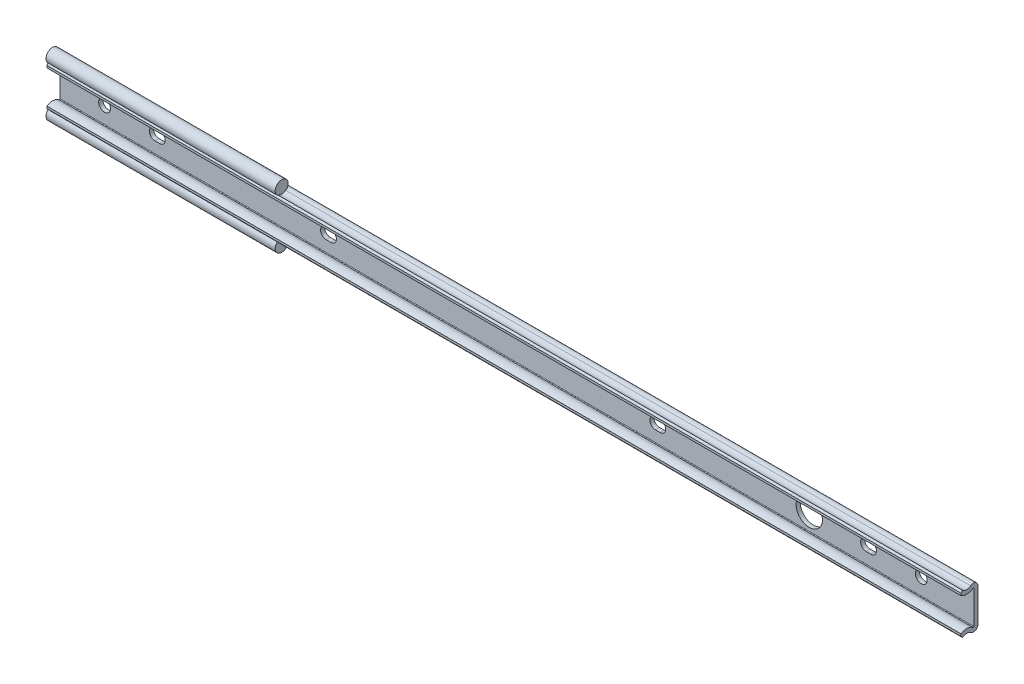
ISO-10303-21;
HEADER;
FILE_DESCRIPTION(('STEP AP214'),'2;1');
FILE_NAME('part.step','',(''),(''),'','','');
FILE_SCHEMA(('AUTOMOTIVE_DESIGN { 1 0 10303 214 1 1 1 1 }'));
ENDSEC;
DATA;
#1=APPLICATION_CONTEXT('core data for automotive mechanical design processes');
#2=APPLICATION_PROTOCOL_DEFINITION('international standard','automotive_design',2000,#1);
#3=PRODUCT_CONTEXT('',#1,'mechanical');
#4=PRODUCT('Part','Part','',(#3));
#5=PRODUCT_RELATED_PRODUCT_CATEGORY('part','',(#4));
#6=PRODUCT_DEFINITION_FORMATION('','',#4);
#7=PRODUCT_DEFINITION_CONTEXT('part definition',#1,'design');
#8=PRODUCT_DEFINITION('design','',#6,#7);
#9=PRODUCT_DEFINITION_SHAPE('','',#8);
#10=(LENGTH_UNIT() NAMED_UNIT(*) SI_UNIT(.MILLI.,.METRE.));
#11=(NAMED_UNIT(*) PLANE_ANGLE_UNIT() SI_UNIT($,.RADIAN.));
#12=(NAMED_UNIT(*) SI_UNIT($,.STERADIAN.) SOLID_ANGLE_UNIT());
#13=UNCERTAINTY_MEASURE_WITH_UNIT(LENGTH_MEASURE(1.E-05),#10,'distance_accuracy_value','');
#14=(GEOMETRIC_REPRESENTATION_CONTEXT(3) GLOBAL_UNCERTAINTY_ASSIGNED_CONTEXT((#13)) GLOBAL_UNIT_ASSIGNED_CONTEXT((#10,
#11,#12)) REPRESENTATION_CONTEXT('',''));
#15=CARTESIAN_POINT('',(0.,0.,0.));
#16=DIRECTION('',(0.,0.,1.));
#17=DIRECTION('',(1.,0.,0.));
#18=AXIS2_PLACEMENT_3D('',#15,#16,#17);
#19=CARTESIAN_POINT('',(330.,9.67006993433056,4.30999988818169));
#20=DIRECTION('',(-1.,0.,0.));
#21=DIRECTION('',(0.,0.,1.));
#22=AXIS2_PLACEMENT_3D('',#19,#20,#21);
#23=CYLINDRICAL_SURFACE('',#22,2.48);
#24=DIRECTION('',(-1.,0.,0.));
#25=VECTOR('',#24,1.);
#26=CARTESIAN_POINT('',(330.,7.6958095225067,2.80910154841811));
#27=LINE('',#26,#25);
#28=CARTESIAN_POINT('',(330.,7.6958095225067,2.80910154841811));
#29=VERTEX_POINT('',#28);
#30=CARTESIAN_POINT('',(70.,7.6958095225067,2.80910154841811));
#31=VERTEX_POINT('',#30);
#32=EDGE_CURVE('E278',#29,#31,#27,.T.);
#33=ORIENTED_EDGE('',*,*,#32,.T.);
#34=CARTESIAN_POINT('',(70.,9.67006993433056,4.30999988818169));
#35=DIRECTION('',(-1.,0.,0.));
#36=DIRECTION('',(0.,0.,1.));
#37=AXIS2_PLACEMENT_3D('',#34,#35,#36);
#38=CIRCLE('',#37,2.48);
#39=CARTESIAN_POINT('',(70.,7.77027971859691,5.9041131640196));
#40=VERTEX_POINT('',#39);
#41=EDGE_CURVE('E392',#31,#40,#38,.T.);
#42=ORIENTED_EDGE('',*,*,#41,.T.);
#43=DIRECTION('',(-1.,0.,0.));
#44=VECTOR('',#43,1.);
#45=CARTESIAN_POINT('',(330.,7.77027971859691,5.9041131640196));
#46=LINE('',#45,#44);
#47=CARTESIAN_POINT('',(330.,7.77027971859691,5.9041131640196));
#48=VERTEX_POINT('',#47);
#49=EDGE_CURVE('E281',#48,#40,#46,.T.);
#50=ORIENTED_EDGE('',*,*,#49,.F.);
#51=CARTESIAN_POINT('',(330.,9.67006993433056,4.30999988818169));
#52=DIRECTION('',(1.,0.,0.));
#53=DIRECTION('',(0.,0.,-1.));
#54=AXIS2_PLACEMENT_3D('',#51,#52,#53);
#55=CIRCLE('',#54,2.48);
#56=EDGE_CURVE('E401',#48,#29,#55,.T.);
#57=ORIENTED_EDGE('',*,*,#56,.T.);
#58=EDGE_LOOP('',(#33,#42,#50,#57));
#59=FACE_BOUND('',#58,.T.);
#60=ADVANCED_FACE('F14',(#59),#23,.F.);
#61=CARTESIAN_POINT('',(330.,-6.30268270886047,1.74999971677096));
#62=DIRECTION('',(-1.,0.,0.));
#63=DIRECTION('',(0.,0.,1.));
#64=AXIS2_PLACEMENT_3D('',#61,#62,#63);
#65=CYLINDRICAL_SURFACE('',#64,1.74999971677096);
#66=CARTESIAN_POINT('',(70.,-6.30268270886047,1.74999971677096));
#67=DIRECTION('',(1.,0.,0.));
#68=DIRECTION('',(0.,0.,-1.));
#69=AXIS2_PLACEMENT_3D('',#66,#67,#68);
#70=CIRCLE('',#69,1.74999971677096);
#71=CARTESIAN_POINT('',(70.,-7.6958095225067,2.80910154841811));
#72=VERTEX_POINT('',#71);
#73=CARTESIAN_POINT('',(70.,-7.94505035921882,2.35425753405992));
#74=VERTEX_POINT('',#73);
#75=EDGE_CURVE('E29',#72,#74,#70,.T.);
#76=ORIENTED_EDGE('',*,*,#75,.T.);
#77=DIRECTION('',(-1.,0.,0.));
#78=VECTOR('',#77,1.);
#79=CARTESIAN_POINT('',(26.5,-7.94505035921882,2.35425753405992));
#80=LINE('',#79,#78);
#81=CARTESIAN_POINT('',(-17.,-7.94505035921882,2.35425753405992));
#82=VERTEX_POINT('',#81);
#83=EDGE_CURVE('E530',#74,#82,#80,.T.);
#84=ORIENTED_EDGE('',*,*,#83,.T.);
#85=CARTESIAN_POINT('',(-17.,-6.30268270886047,1.74999971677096));
#86=DIRECTION('',(1.,0.,0.));
#87=DIRECTION('',(0.,0.,-1.));
#88=AXIS2_PLACEMENT_3D('',#85,#86,#87);
#89=CIRCLE('',#88,1.74999971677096);
#90=CARTESIAN_POINT('',(-17.,-6.30268270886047,0.));
#91=VERTEX_POINT('',#90);
#92=EDGE_CURVE('E432',#82,#91,#89,.T.);
#93=ORIENTED_EDGE('',*,*,#92,.T.);
#94=DIRECTION('',(-1.,0.,0.));
#95=VECTOR('',#94,1.);
#96=CARTESIAN_POINT('',(330.,-6.30268270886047,0.));
#97=LINE('',#96,#95);
#98=CARTESIAN_POINT('',(330.,-6.30268270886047,0.));
#99=VERTEX_POINT('',#98);
#100=EDGE_CURVE('E324',#99,#91,#97,.T.);
#101=ORIENTED_EDGE('',*,*,#100,.F.);
#102=CARTESIAN_POINT('',(330.,-6.30268270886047,1.74999971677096));
#103=DIRECTION('',(1.,0.,0.));
#104=DIRECTION('',(0.,0.,-1.));
#105=AXIS2_PLACEMENT_3D('',#102,#103,#104);
#106=CIRCLE('',#105,1.74999971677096);
#107=CARTESIAN_POINT('',(330.,-7.6958095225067,2.80910154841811));
#108=VERTEX_POINT('',#107);
#109=EDGE_CURVE('E294',#108,#99,#106,.T.);
#110=ORIENTED_EDGE('',*,*,#109,.F.);
#111=DIRECTION('',(-1.,0.,0.));
#112=VECTOR('',#111,1.);
#113=CARTESIAN_POINT('',(330.,-7.6958095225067,2.80910154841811));
#114=LINE('',#113,#112);
#115=EDGE_CURVE('E310',#108,#72,#114,.T.);
#116=ORIENTED_EDGE('',*,*,#115,.T.);
#117=EDGE_LOOP('',(#76,#84,#93,#101,#110,#116));
#118=FACE_BOUND('',#117,.T.);
#119=ADVANCED_FACE('F16',(#118),#65,.T.);
#120=CARTESIAN_POINT('',(330.,-6.30268270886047,0.));
#121=DIRECTION('',(0.,0.,1.));
#122=DIRECTION('',(0.,-1.,0.));
#123=AXIS2_PLACEMENT_3D('',#120,#121,#122);
#124=PLANE('',#123);
#125=CARTESIAN_POINT('',(310.,0.,0.));
#126=DIRECTION('',(0.,0.,-1.));
#127=DIRECTION('',(0.,1.,0.));
#128=AXIS2_PLACEMENT_3D('',#125,#126,#127);
#129=CIRCLE('',#128,2.24999999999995);
#130=CARTESIAN_POINT('',(310.,2.24999999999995,0.));
#131=VERTEX_POINT('',#130);
#132=EDGE_CURVE('E356',#131,#131,#129,.T.);
#133=ORIENTED_EDGE('',*,*,#132,.F.);
#134=EDGE_LOOP('',(#133));
#135=FACE_BOUND('',#134,.T.);
#136=DIRECTION('',(-1.,0.,0.));
#137=VECTOR('',#136,1.);
#138=CARTESIAN_POINT('',(20.9,-2.1,0.));
#139=LINE('',#138,#137);
#140=CARTESIAN_POINT('',(20.9,-2.1,0.));
#141=VERTEX_POINT('',#140);
#142=CARTESIAN_POINT('',(19.1,-2.1,0.));
#143=VERTEX_POINT('',#142);
#144=EDGE_CURVE('E501',#141,#143,#139,.T.);
#145=ORIENTED_EDGE('',*,*,#144,.F.);
#146=CARTESIAN_POINT('',(20.9,0.,0.));
#147=DIRECTION('',(0.,0.,-1.));
#148=DIRECTION('',(0.,1.,0.));
#149=AXIS2_PLACEMENT_3D('',#146,#147,#148);
#150=CIRCLE('',#149,2.1);
#151=CARTESIAN_POINT('',(20.9,2.1,0.));
#152=VERTEX_POINT('',#151);
#153=EDGE_CURVE('E245',#152,#141,#150,.T.);
#154=ORIENTED_EDGE('',*,*,#153,.F.);
#155=DIRECTION('',(1.,0.,0.));
#156=VECTOR('',#155,1.);
#157=CARTESIAN_POINT('',(20.9,2.1,0.));
#158=LINE('',#157,#156);
#159=CARTESIAN_POINT('',(19.1,2.1,0.));
#160=VERTEX_POINT('',#159);
#161=EDGE_CURVE('E489',#160,#152,#158,.T.);
#162=ORIENTED_EDGE('',*,*,#161,.F.);
#163=CARTESIAN_POINT('',(19.1,0.,0.));
#164=DIRECTION('',(0.,0.,-1.));
#165=DIRECTION('',(0.,1.,0.));
#166=AXIS2_PLACEMENT_3D('',#163,#164,#165);
#167=CIRCLE('',#166,2.1);
#168=EDGE_CURVE('E498',#143,#160,#167,.T.);
#169=ORIENTED_EDGE('',*,*,#168,.F.);
#170=EDGE_LOOP('',(#145,#154,#162,#169));
#171=FACE_BOUND('',#170,.T.);
#172=DIRECTION('',(-1.,0.,0.));
#173=VECTOR('',#172,1.);
#174=CARTESIAN_POINT('',(85.9,-2.1,0.));
#175=LINE('',#174,#173);
#176=CARTESIAN_POINT('',(85.9,-2.1,0.));
#177=VERTEX_POINT('',#176);
#178=CARTESIAN_POINT('',(84.1,-2.1,0.));
#179=VERTEX_POINT('',#178);
#180=EDGE_CURVE('E519',#177,#179,#175,.T.);
#181=ORIENTED_EDGE('',*,*,#180,.F.);
#182=CARTESIAN_POINT('',(85.9,0.,0.));
#183=DIRECTION('',(0.,0.,-1.));
#184=DIRECTION('',(0.,1.,0.));
#185=AXIS2_PLACEMENT_3D('',#182,#183,#184);
#186=CIRCLE('',#185,2.1);
#187=CARTESIAN_POINT('',(85.9,2.1,0.));
#188=VERTEX_POINT('',#187);
#189=EDGE_CURVE('E495',#188,#177,#186,.T.);
#190=ORIENTED_EDGE('',*,*,#189,.F.);
#191=DIRECTION('',(1.,0.,0.));
#192=VECTOR('',#191,1.);
#193=CARTESIAN_POINT('',(85.9,2.1,0.));
#194=LINE('',#193,#192);
#195=CARTESIAN_POINT('',(84.1,2.1,0.));
#196=VERTEX_POINT('',#195);
#197=EDGE_CURVE('E509',#196,#188,#194,.T.);
#198=ORIENTED_EDGE('',*,*,#197,.F.);
#199=CARTESIAN_POINT('',(84.1,0.,0.));
#200=DIRECTION('',(0.,0.,-1.));
#201=DIRECTION('',(0.,1.,0.));
#202=AXIS2_PLACEMENT_3D('',#199,#200,#201);
#203=CIRCLE('',#202,2.1);
#204=EDGE_CURVE('E516',#179,#196,#203,.T.);
#205=ORIENTED_EDGE('',*,*,#204,.F.);
#206=EDGE_LOOP('',(#181,#190,#198,#205));
#207=FACE_BOUND('',#206,.T.);
#208=CARTESIAN_POINT('',(0.,0.,0.));
#209=DIRECTION('',(0.,0.,-1.));
#210=DIRECTION('',(0.,1.,0.));
#211=AXIS2_PLACEMENT_3D('',#208,#209,#210);
#212=CIRCLE('',#211,2.25);
#213=CARTESIAN_POINT('',(0.,2.25,0.));
#214=VERTEX_POINT('',#213);
#215=EDGE_CURVE('E441',#214,#214,#212,.T.);
#216=ORIENTED_EDGE('',*,*,#215,.F.);
#217=EDGE_LOOP('',(#216));
#218=FACE_BOUND('',#217,.T.);
#219=CARTESIAN_POINT('',(267.5,0.,0.));
#220=DIRECTION('',(0.,0.,-1.));
#221=DIRECTION('',(0.,1.,0.));
#222=AXIS2_PLACEMENT_3D('',#219,#220,#221);
#223=CIRCLE('',#222,5.);
#224=CARTESIAN_POINT('',(267.5,5.,0.));
#225=VERTEX_POINT('',#224);
#226=EDGE_CURVE('E438',#225,#225,#223,.T.);
#227=ORIENTED_EDGE('',*,*,#226,.F.);
#228=EDGE_LOOP('',(#227));
#229=FACE_BOUND('',#228,.T.);
#230=DIRECTION('',(-1.,0.,0.));
#231=VECTOR('',#230,1.);
#232=CARTESIAN_POINT('',(290.9,-2.1,0.));
#233=LINE('',#232,#231);
#234=CARTESIAN_POINT('',(290.9,-2.1,0.));
#235=VERTEX_POINT('',#234);
#236=CARTESIAN_POINT('',(289.1,-2.1,0.));
#237=VERTEX_POINT('',#236);
#238=EDGE_CURVE('E481',#235,#237,#233,.T.);
#239=ORIENTED_EDGE('',*,*,#238,.F.);
#240=CARTESIAN_POINT('',(290.9,0.,0.));
#241=DIRECTION('',(0.,0.,-1.));
#242=DIRECTION('',(0.,1.,0.));
#243=AXIS2_PLACEMENT_3D('',#240,#241,#242);
#244=CIRCLE('',#243,2.1);
#245=CARTESIAN_POINT('',(290.9,2.1,0.));
#246=VERTEX_POINT('',#245);
#247=EDGE_CURVE('E455',#246,#235,#244,.T.);
#248=ORIENTED_EDGE('',*,*,#247,.F.);
#249=DIRECTION('',(1.,0.,0.));
#250=VECTOR('',#249,1.);
#251=CARTESIAN_POINT('',(290.9,2.1,0.));
#252=LINE('',#251,#250);
#253=CARTESIAN_POINT('',(289.1,2.1,0.));
#254=VERTEX_POINT('',#253);
#255=EDGE_CURVE('E471',#254,#246,#252,.T.);
#256=ORIENTED_EDGE('',*,*,#255,.F.);
#257=CARTESIAN_POINT('',(289.1,0.,0.));
#258=DIRECTION('',(0.,0.,-1.));
#259=DIRECTION('',(0.,1.,0.));
#260=AXIS2_PLACEMENT_3D('',#257,#258,#259);
#261=CIRCLE('',#260,2.1);
#262=EDGE_CURVE('E478',#237,#254,#261,.T.);
#263=ORIENTED_EDGE('',*,*,#262,.F.);
#264=EDGE_LOOP('',(#239,#248,#256,#263));
#265=FACE_BOUND('',#264,.T.);
#266=DIRECTION('',(-1.,0.,0.));
#267=VECTOR('',#266,1.);
#268=CARTESIAN_POINT('',(210.9,-2.1,0.));
#269=LINE('',#268,#267);
#270=CARTESIAN_POINT('',(210.9,-2.1,0.));
#271=VERTEX_POINT('',#270);
#272=CARTESIAN_POINT('',(209.1,-2.1,0.));
#273=VERTEX_POINT('',#272);
#274=EDGE_CURVE('E461',#271,#273,#269,.T.);
#275=ORIENTED_EDGE('',*,*,#274,.F.);
#276=CARTESIAN_POINT('',(210.9,0.,0.));
#277=DIRECTION('',(0.,0.,-1.));
#278=DIRECTION('',(0.,1.,0.));
#279=AXIS2_PLACEMENT_3D('',#276,#277,#278);
#280=CIRCLE('',#279,2.1);
#281=CARTESIAN_POINT('',(210.9,2.1,0.));
#282=VERTEX_POINT('',#281);
#283=EDGE_CURVE('E464',#282,#271,#280,.T.);
#284=ORIENTED_EDGE('',*,*,#283,.F.);
#285=DIRECTION('',(1.,0.,0.));
#286=VECTOR('',#285,1.);
#287=CARTESIAN_POINT('',(210.9,2.1,0.));
#288=LINE('',#287,#286);
#289=CARTESIAN_POINT('',(209.1,2.1,0.));
#290=VERTEX_POINT('',#289);
#291=EDGE_CURVE('E449',#290,#282,#288,.T.);
#292=ORIENTED_EDGE('',*,*,#291,.F.);
#293=CARTESIAN_POINT('',(209.1,0.,0.));
#294=DIRECTION('',(0.,0.,-1.));
#295=DIRECTION('',(0.,1.,0.));
#296=AXIS2_PLACEMENT_3D('',#293,#294,#295);
#297=CIRCLE('',#296,2.1);
#298=EDGE_CURVE('E458',#273,#290,#297,.T.);
#299=ORIENTED_EDGE('',*,*,#298,.F.);
#300=EDGE_LOOP('',(#275,#284,#292,#299));
#301=FACE_BOUND('',#300,.T.);
#302=ORIENTED_EDGE('',*,*,#100,.T.);
#303=DIRECTION('',(0.,1.,0.));
#304=VECTOR('',#303,1.);
#305=CARTESIAN_POINT('',(-17.,-6.30268270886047,0.));
#306=LINE('',#305,#304);
#307=CARTESIAN_POINT('',(-17.,6.30268270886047,0.));
#308=VERTEX_POINT('',#307);
#309=EDGE_CURVE('E276',#91,#308,#306,.T.);
#310=ORIENTED_EDGE('',*,*,#309,.T.);
#311=DIRECTION('',(-1.,0.,0.));
#312=VECTOR('',#311,1.);
#313=CARTESIAN_POINT('',(330.,6.30268270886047,0.));
#314=LINE('',#313,#312);
#315=CARTESIAN_POINT('',(330.,6.30268270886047,0.));
#316=VERTEX_POINT('',#315);
#317=EDGE_CURVE('E263',#316,#308,#314,.T.);
#318=ORIENTED_EDGE('',*,*,#317,.F.);
#319=DIRECTION('',(0.,1.,0.));
#320=VECTOR('',#319,1.);
#321=CARTESIAN_POINT('',(330.,-6.30268270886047,0.));
#322=LINE('',#321,#320);
#323=EDGE_CURVE('E296',#99,#316,#322,.T.);
#324=ORIENTED_EDGE('',*,*,#323,.F.);
#325=EDGE_LOOP('',(#302,#310,#318,#324));
#326=FACE_BOUND('',#325,.T.);
#327=ADVANCED_FACE('F600',(#135,#171,#207,#218,#229,#265,#301,#326),#124,.F.);
#328=CARTESIAN_POINT('',(330.,-6.30268270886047,1.54999999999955));
#329=DIRECTION('',(0.,0.,-1.));
#330=DIRECTION('',(-1.,0.,0.));
#331=AXIS2_PLACEMENT_3D('',#328,#329,#330);
#332=PLANE('',#331);
#333=CARTESIAN_POINT('',(310.,0.,1.54999999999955));
#334=DIRECTION('',(0.,0.,-1.));
#335=DIRECTION('',(-1.,0.,0.));
#336=AXIS2_PLACEMENT_3D('',#333,#334,#335);
#337=CIRCLE('',#336,2.24999999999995);
#338=CARTESIAN_POINT('',(307.75,0.,1.54999999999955));
#339=VERTEX_POINT('',#338);
#340=EDGE_CURVE('E359',#339,#339,#337,.T.);
#341=ORIENTED_EDGE('',*,*,#340,.T.);
#342=EDGE_LOOP('',(#341));
#343=FACE_BOUND('',#342,.T.);
#344=DIRECTION('',(1.,0.,0.));
#345=VECTOR('',#344,1.);
#346=CARTESIAN_POINT('',(330.,2.09999999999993,1.54999999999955));
#347=LINE('',#346,#345);
#348=CARTESIAN_POINT('',(19.1,2.1,1.54999999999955));
#349=VERTEX_POINT('',#348);
#350=CARTESIAN_POINT('',(20.9,2.1,1.54999999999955));
#351=VERTEX_POINT('',#350);
#352=EDGE_CURVE('E377',#349,#351,#347,.T.);
#353=ORIENTED_EDGE('',*,*,#352,.T.);
#354=CARTESIAN_POINT('',(20.9,0.,1.54999999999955));
#355=DIRECTION('',(0.,0.,-1.));
#356=DIRECTION('',(-1.,0.,0.));
#357=AXIS2_PLACEMENT_3D('',#354,#355,#356);
#358=CIRCLE('',#357,2.1);
#359=CARTESIAN_POINT('',(20.9,-2.1,1.54999999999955));
#360=VERTEX_POINT('',#359);
#361=EDGE_CURVE('E380',#351,#360,#358,.T.);
#362=ORIENTED_EDGE('',*,*,#361,.T.);
#363=DIRECTION('',(-1.,0.,0.));
#364=VECTOR('',#363,1.);
#365=CARTESIAN_POINT('',(330.,-2.1,1.54999999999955));
#366=LINE('',#365,#364);
#367=CARTESIAN_POINT('',(19.1,-2.1,1.54999999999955));
#368=VERTEX_POINT('',#367);
#369=EDGE_CURVE('E371',#360,#368,#366,.T.);
#370=ORIENTED_EDGE('',*,*,#369,.T.);
#371=CARTESIAN_POINT('',(19.1,0.,1.54999999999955));
#372=DIRECTION('',(0.,0.,-1.));
#373=DIRECTION('',(-1.,0.,0.));
#374=AXIS2_PLACEMENT_3D('',#371,#372,#373);
#375=CIRCLE('',#374,2.1);
#376=EDGE_CURVE('E374',#368,#349,#375,.T.);
#377=ORIENTED_EDGE('',*,*,#376,.T.);
#378=EDGE_LOOP('',(#353,#362,#370,#377));
#379=FACE_BOUND('',#378,.T.);
#380=DIRECTION('',(1.,0.,0.));
#381=VECTOR('',#380,1.);
#382=CARTESIAN_POINT('',(330.,2.09999999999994,1.54999999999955));
#383=LINE('',#382,#381);
#384=CARTESIAN_POINT('',(84.1,2.1,1.54999999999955));
#385=VERTEX_POINT('',#384);
#386=CARTESIAN_POINT('',(85.9,2.1,1.54999999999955));
#387=VERTEX_POINT('',#386);
#388=EDGE_CURVE('E365',#385,#387,#383,.T.);
#389=ORIENTED_EDGE('',*,*,#388,.T.);
#390=CARTESIAN_POINT('',(85.9,0.,1.54999999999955));
#391=DIRECTION('',(0.,0.,-1.));
#392=DIRECTION('',(-1.,0.,0.));
#393=AXIS2_PLACEMENT_3D('',#390,#391,#392);
#394=CIRCLE('',#393,2.1);
#395=CARTESIAN_POINT('',(85.9,-2.1,1.54999999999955));
#396=VERTEX_POINT('',#395);
#397=EDGE_CURVE('E368',#387,#396,#394,.T.);
#398=ORIENTED_EDGE('',*,*,#397,.T.);
#399=DIRECTION('',(-1.,0.,0.));
#400=VECTOR('',#399,1.);
#401=CARTESIAN_POINT('',(330.,-2.1,1.54999999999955));
#402=LINE('',#401,#400);
#403=CARTESIAN_POINT('',(84.1,-2.1,1.54999999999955));
#404=VERTEX_POINT('',#403);
#405=EDGE_CURVE('E351',#396,#404,#402,.T.);
#406=ORIENTED_EDGE('',*,*,#405,.T.);
#407=CARTESIAN_POINT('',(84.1,0.,1.54999999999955));
#408=DIRECTION('',(0.,0.,-1.));
#409=DIRECTION('',(-1.,0.,0.));
#410=AXIS2_PLACEMENT_3D('',#407,#408,#409);
#411=CIRCLE('',#410,2.1);
#412=EDGE_CURVE('E362',#404,#385,#411,.T.);
#413=ORIENTED_EDGE('',*,*,#412,.T.);
#414=EDGE_LOOP('',(#389,#398,#406,#413));
#415=FACE_BOUND('',#414,.T.);
#416=CARTESIAN_POINT('',(0.,0.,1.54999999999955));
#417=DIRECTION('',(0.,0.,-1.));
#418=DIRECTION('',(-1.,0.,0.));
#419=AXIS2_PLACEMENT_3D('',#416,#417,#418);
#420=CIRCLE('',#419,2.25);
#421=CARTESIAN_POINT('',(-2.25,0.,1.54999999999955));
#422=VERTEX_POINT('',#421);
#423=EDGE_CURVE('E355',#422,#422,#420,.T.);
#424=ORIENTED_EDGE('',*,*,#423,.T.);
#425=EDGE_LOOP('',(#424));
#426=FACE_BOUND('',#425,.T.);
#427=CARTESIAN_POINT('',(267.5,0.,1.54999999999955));
#428=DIRECTION('',(0.,0.,-1.));
#429=DIRECTION('',(-1.,0.,0.));
#430=AXIS2_PLACEMENT_3D('',#427,#428,#429);
#431=CIRCLE('',#430,5.);
#432=CARTESIAN_POINT('',(262.5,0.,1.54999999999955));
#433=VERTEX_POINT('',#432);
#434=EDGE_CURVE('E352',#433,#433,#431,.T.);
#435=ORIENTED_EDGE('',*,*,#434,.T.);
#436=EDGE_LOOP('',(#435));
#437=FACE_BOUND('',#436,.T.);
#438=DIRECTION('',(1.,0.,0.));
#439=VECTOR('',#438,1.);
#440=CARTESIAN_POINT('',(330.,2.1,1.54999999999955));
#441=LINE('',#440,#439);
#442=CARTESIAN_POINT('',(289.1,2.1,1.54999999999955));
#443=VERTEX_POINT('',#442);
#444=CARTESIAN_POINT('',(290.9,2.1,1.54999999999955));
#445=VERTEX_POINT('',#444);
#446=EDGE_CURVE('E345',#443,#445,#441,.T.);
#447=ORIENTED_EDGE('',*,*,#446,.T.);
#448=CARTESIAN_POINT('',(290.9,0.,1.54999999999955));
#449=DIRECTION('',(0.,0.,-1.));
#450=DIRECTION('',(-1.,0.,0.));
#451=AXIS2_PLACEMENT_3D('',#448,#449,#450);
#452=CIRCLE('',#451,2.1);
#453=CARTESIAN_POINT('',(290.9,-2.1,1.54999999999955));
#454=VERTEX_POINT('',#453);
#455=EDGE_CURVE('E348',#445,#454,#452,.T.);
#456=ORIENTED_EDGE('',*,*,#455,.T.);
#457=DIRECTION('',(-1.,0.,0.));
#458=VECTOR('',#457,1.);
#459=CARTESIAN_POINT('',(330.,-2.1,1.54999999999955));
#460=LINE('',#459,#458);
#461=CARTESIAN_POINT('',(289.1,-2.1,1.54999999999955));
#462=VERTEX_POINT('',#461);
#463=EDGE_CURVE('E339',#454,#462,#460,.T.);
#464=ORIENTED_EDGE('',*,*,#463,.T.);
#465=CARTESIAN_POINT('',(289.1,0.,1.54999999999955));
#466=DIRECTION('',(0.,0.,-1.));
#467=DIRECTION('',(-1.,0.,0.));
#468=AXIS2_PLACEMENT_3D('',#465,#466,#467);
#469=CIRCLE('',#468,2.1);
#470=EDGE_CURVE('E342',#462,#443,#469,.T.);
#471=ORIENTED_EDGE('',*,*,#470,.T.);
#472=EDGE_LOOP('',(#447,#456,#464,#471));
#473=FACE_BOUND('',#472,.T.);
#474=DIRECTION('',(1.,0.,0.));
#475=VECTOR('',#474,1.);
#476=CARTESIAN_POINT('',(330.,2.09999999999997,1.54999999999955));
#477=LINE('',#476,#475);
#478=CARTESIAN_POINT('',(209.1,2.1,1.54999999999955));
#479=VERTEX_POINT('',#478);
#480=CARTESIAN_POINT('',(210.9,2.1,1.54999999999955));
#481=VERTEX_POINT('',#480);
#482=EDGE_CURVE('E333',#479,#481,#477,.T.);
#483=ORIENTED_EDGE('',*,*,#482,.T.);
#484=CARTESIAN_POINT('',(210.9,0.,1.54999999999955));
#485=DIRECTION('',(0.,0.,-1.));
#486=DIRECTION('',(-1.,0.,0.));
#487=AXIS2_PLACEMENT_3D('',#484,#485,#486);
#488=CIRCLE('',#487,2.1);
#489=CARTESIAN_POINT('',(210.9,-2.1,1.54999999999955));
#490=VERTEX_POINT('',#489);
#491=EDGE_CURVE('E336',#481,#490,#488,.T.);
#492=ORIENTED_EDGE('',*,*,#491,.T.);
#493=DIRECTION('',(-1.,0.,0.));
#494=VECTOR('',#493,1.);
#495=CARTESIAN_POINT('',(330.,-2.1,1.54999999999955));
#496=LINE('',#495,#494);
#497=CARTESIAN_POINT('',(209.1,-2.1,1.54999999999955));
#498=VERTEX_POINT('',#497);
#499=EDGE_CURVE('E327',#490,#498,#496,.T.);
#500=ORIENTED_EDGE('',*,*,#499,.T.);
#501=CARTESIAN_POINT('',(209.1,0.,1.54999999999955));
#502=DIRECTION('',(0.,0.,-1.));
#503=DIRECTION('',(-1.,0.,0.));
#504=AXIS2_PLACEMENT_3D('',#501,#502,#503);
#505=CIRCLE('',#504,2.1);
#506=EDGE_CURVE('E330',#498,#479,#505,.T.);
#507=ORIENTED_EDGE('',*,*,#506,.T.);
#508=EDGE_LOOP('',(#483,#492,#500,#507));
#509=FACE_BOUND('',#508,.T.);
#510=DIRECTION('',(0.,-1.,0.));
#511=VECTOR('',#510,1.);
#512=CARTESIAN_POINT('',(-17.,-6.30268270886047,1.54999999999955));
#513=LINE('',#512,#511);
#514=CARTESIAN_POINT('',(-17.,6.30268270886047,1.54999999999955));
#515=VERTEX_POINT('',#514);
#516=CARTESIAN_POINT('',(-17.,-6.30268270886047,1.54999999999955));
#517=VERTEX_POINT('',#516);
#518=EDGE_CURVE('E292',#515,#517,#513,.T.);
#519=ORIENTED_EDGE('',*,*,#518,.T.);
#520=DIRECTION('',(-1.,0.,0.));
#521=VECTOR('',#520,1.);
#522=CARTESIAN_POINT('',(330.,-6.30268270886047,1.54999999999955));
#523=LINE('',#522,#521);
#524=CARTESIAN_POINT('',(330.,-6.30268270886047,1.54999999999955));
#525=VERTEX_POINT('',#524);
#526=EDGE_CURVE('E321',#525,#517,#523,.T.);
#527=ORIENTED_EDGE('',*,*,#526,.F.);
#528=DIRECTION('',(0.,-1.,0.));
#529=VECTOR('',#528,1.);
#530=CARTESIAN_POINT('',(330.,-6.30268270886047,1.54999999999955));
#531=LINE('',#530,#529);
#532=CARTESIAN_POINT('',(330.,6.30268270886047,1.54999999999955));
#533=VERTEX_POINT('',#532);
#534=EDGE_CURVE('E298',#533,#525,#531,.T.);
#535=ORIENTED_EDGE('',*,*,#534,.F.);
#536=DIRECTION('',(-1.,0.,0.));
#537=VECTOR('',#536,1.);
#538=CARTESIAN_POINT('',(330.,6.30268270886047,1.54999999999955));
#539=LINE('',#538,#537);
#540=EDGE_CURVE('E273',#533,#515,#539,.T.);
#541=ORIENTED_EDGE('',*,*,#540,.T.);
#542=EDGE_LOOP('',(#519,#527,#535,#541));
#543=FACE_BOUND('',#542,.T.);
#544=ADVANCED_FACE('F572',(#343,#379,#415,#426,#437,#473,#509,#543),#332,.F.);
#545=CARTESIAN_POINT('',(330.,-6.30268270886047,1.74999971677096));
#546=DIRECTION('',(-1.,0.,0.));
#547=DIRECTION('',(0.,0.,1.));
#548=AXIS2_PLACEMENT_3D('',#545,#546,#547);
#549=CYLINDRICAL_SURFACE('',#548,0.199999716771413);
#550=ORIENTED_EDGE('',*,*,#526,.T.);
#551=CARTESIAN_POINT('',(-17.,-6.30268270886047,1.74999971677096));
#552=DIRECTION('',(1.,0.,0.));
#553=DIRECTION('',(0.,0.,-1.));
#554=AXIS2_PLACEMENT_3D('',#551,#552,#553);
#555=CIRCLE('',#554,0.199999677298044);
#556=CARTESIAN_POINT('',(-17.,-6.4618966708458,1.87104001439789));
#557=VERTEX_POINT('',#556);
#558=EDGE_CURVE('E417',#517,#557,#555,.F.);
#559=ORIENTED_EDGE('',*,*,#558,.T.);
#560=DIRECTION('',(-1.,0.,0.));
#561=VECTOR('',#560,1.);
#562=CARTESIAN_POINT('',(330.,-6.46189676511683,1.87104008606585));
#563=LINE('',#562,#561);
#564=CARTESIAN_POINT('',(330.,-6.46189676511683,1.87104008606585));
#565=VERTEX_POINT('',#564);
#566=EDGE_CURVE('E319',#565,#557,#563,.T.);
#567=ORIENTED_EDGE('',*,*,#566,.F.);
#568=CARTESIAN_POINT('',(330.,-6.30268270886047,1.74999971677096));
#569=DIRECTION('',(-1.,0.,0.));
#570=DIRECTION('',(0.,0.,-1.));
#571=AXIS2_PLACEMENT_3D('',#568,#569,#570);
#572=CIRCLE('',#571,0.199999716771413);
#573=EDGE_CURVE('E300',#525,#565,#572,.T.);
#574=ORIENTED_EDGE('',*,*,#573,.F.);
#575=EDGE_LOOP('',(#550,#559,#567,#574));
#576=FACE_BOUND('',#575,.T.);
#577=ADVANCED_FACE('F568',(#576),#549,.F.);
#578=CARTESIAN_POINT('',(330.,-9.67006993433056,4.30999988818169));
#579=DIRECTION('',(-1.,0.,0.));
#580=DIRECTION('',(0.,0.,1.));
#581=AXIS2_PLACEMENT_3D('',#578,#579,#580);
#582=CYLINDRICAL_SURFACE('',#581,4.03);
#583=ORIENTED_EDGE('',*,*,#566,.T.);
#584=CARTESIAN_POINT('',(-17.,-9.67006993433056,4.30999988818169));
#585=DIRECTION('',(1.,0.,0.));
#586=DIRECTION('',(0.,0.,-1.));
#587=AXIS2_PLACEMENT_3D('',#584,#585,#586);
#588=CIRCLE('',#587,4.03000011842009);
#589=CARTESIAN_POINT('',(-17.,-6.26782067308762,6.47000017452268));
#590=VERTEX_POINT('',#589);
#591=EDGE_CURVE('E386',#557,#590,#588,.T.);
#592=ORIENTED_EDGE('',*,*,#591,.T.);
#593=DIRECTION('',(-1.,0.,0.));
#594=VECTOR('',#593,1.);
#595=CARTESIAN_POINT('',(330.,-6.26782067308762,6.46999987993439));
#596=LINE('',#595,#594);
#597=CARTESIAN_POINT('',(330.,-6.26782067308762,6.46999987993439));
#598=VERTEX_POINT('',#597);
#599=EDGE_CURVE('E317',#598,#590,#596,.T.);
#600=ORIENTED_EDGE('',*,*,#599,.F.);
#601=CARTESIAN_POINT('',(330.,-9.67006993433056,4.30999988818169));
#602=DIRECTION('',(1.,0.,0.));
#603=DIRECTION('',(0.,0.,-1.));
#604=AXIS2_PLACEMENT_3D('',#601,#602,#603);
#605=CIRCLE('',#604,4.03);
#606=EDGE_CURVE('E302',#565,#598,#605,.T.);
#607=ORIENTED_EDGE('',*,*,#606,.F.);
#608=EDGE_LOOP('',(#583,#592,#600,#607));
#609=FACE_BOUND('',#608,.T.);
#610=ADVANCED_FACE('F564',(#609),#582,.T.);
#611=CARTESIAN_POINT('',(330.,-6.26782067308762,6.46999987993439));
#612=DIRECTION('',(0.,0.,-1.));
#613=DIRECTION('',(-1.,0.,0.));
#614=AXIS2_PLACEMENT_3D('',#611,#612,#613);
#615=PLANE('',#614);
#616=ORIENTED_EDGE('',*,*,#599,.T.);
#617=DIRECTION('',(0.,-1.,0.));
#618=VECTOR('',#617,1.);
#619=CARTESIAN_POINT('',(-17.,-7.09588258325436,6.47000017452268));
#620=LINE('',#619,#618);
#621=CARTESIAN_POINT('',(-17.,-7.09588258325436,6.47000017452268));
#622=VERTEX_POINT('',#621);
#623=EDGE_CURVE('E429',#590,#622,#620,.T.);
#624=ORIENTED_EDGE('',*,*,#623,.T.);
#625=DIRECTION('',(-1.,0.,0.));
#626=VECTOR('',#625,1.);
#627=CARTESIAN_POINT('',(330.,-7.09588293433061,6.46999987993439));
#628=LINE('',#627,#626);
#629=CARTESIAN_POINT('',(330.,-7.09588293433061,6.46999987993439));
#630=VERTEX_POINT('',#629);
#631=EDGE_CURVE('E315',#630,#622,#628,.T.);
#632=ORIENTED_EDGE('',*,*,#631,.F.);
#633=DIRECTION('',(0.,-1.,0.));
#634=VECTOR('',#633,1.);
#635=CARTESIAN_POINT('',(330.,-6.26782067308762,6.46999987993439));
#636=LINE('',#635,#634);
#637=EDGE_CURVE('E304',#598,#630,#636,.T.);
#638=ORIENTED_EDGE('',*,*,#637,.F.);
#639=EDGE_LOOP('',(#616,#624,#632,#638));
#640=FACE_BOUND('',#639,.T.);
#641=ADVANCED_FACE('F560',(#640),#615,.F.);
#642=CARTESIAN_POINT('',(330.,-7.77027971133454,5.90411315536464));
#643=DIRECTION('',(0.,0.642788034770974,-0.766044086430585));
#644=DIRECTION('',(0.,0.766044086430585,0.642788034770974));
#645=AXIS2_PLACEMENT_3D('',#642,#643,#644);
#646=PLANE('',#645);
#647=DIRECTION('',(0.,-0.766044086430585,-0.642788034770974));
#648=VECTOR('',#647,1.);
#649=CARTESIAN_POINT('',(-17.,-7.77027971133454,5.90411315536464));
#650=LINE('',#649,#648);
#651=CARTESIAN_POINT('',(-17.,-7.6554298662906,6.00048372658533));
#652=VERTEX_POINT('',#651);
#653=EDGE_CURVE('E434',#622,#652,#650,.T.);
#654=ORIENTED_EDGE('',*,*,#653,.T.);
#655=DIRECTION('',(-1.,0.,0.));
#656=VECTOR('',#655,1.);
#657=CARTESIAN_POINT('',(70.,-7.65542986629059,6.00048372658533));
#658=LINE('',#657,#656);
#659=CARTESIAN_POINT('',(70.,-7.6554298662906,6.00048372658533));
#660=VERTEX_POINT('',#659);
#661=EDGE_CURVE('E37',#652,#660,#658,.F.);
#662=ORIENTED_EDGE('',*,*,#661,.T.);
#663=DIRECTION('',(0.,-0.766044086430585,-0.642788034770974));
#664=VECTOR('',#663,1.);
#665=CARTESIAN_POINT('',(70.,-7.77027971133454,5.90411315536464));
#666=LINE('',#665,#664);
#667=CARTESIAN_POINT('',(70.,-7.77027971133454,5.90411315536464));
#668=VERTEX_POINT('',#667);
#669=EDGE_CURVE('E528',#660,#668,#666,.T.);
#670=ORIENTED_EDGE('',*,*,#669,.T.);
#671=DIRECTION('',(-1.,0.,0.));
#672=VECTOR('',#671,1.);
#673=CARTESIAN_POINT('',(330.,-7.77027971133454,5.90411315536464));
#674=LINE('',#673,#672);
#675=CARTESIAN_POINT('',(330.,-7.77027971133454,5.90411315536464));
#676=VERTEX_POINT('',#675);
#677=EDGE_CURVE('E312',#676,#668,#674,.T.);
#678=ORIENTED_EDGE('',*,*,#677,.F.);
#679=DIRECTION('',(0.,-0.766044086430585,-0.642788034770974));
#680=VECTOR('',#679,1.);
#681=CARTESIAN_POINT('',(330.,-7.77027971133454,5.90411315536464));
#682=LINE('',#681,#680);
#683=EDGE_CURVE('E306',#630,#676,#682,.T.);
#684=ORIENTED_EDGE('',*,*,#683,.F.);
#685=ORIENTED_EDGE('',*,*,#631,.T.);
#686=EDGE_LOOP('',(#654,#662,#670,#678,#684,#685));
#687=FACE_BOUND('',#686,.T.);
#688=ADVANCED_FACE('F546',(#687),#646,.F.);
#689=CARTESIAN_POINT('',(330.,-9.67006993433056,4.30999988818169));
#690=DIRECTION('',(-1.,0.,0.));
#691=DIRECTION('',(0.,0.,1.));
#692=AXIS2_PLACEMENT_3D('',#689,#690,#691);
#693=CYLINDRICAL_SURFACE('',#692,2.48);
#694=ORIENTED_EDGE('',*,*,#677,.T.);
#695=CARTESIAN_POINT('',(70.,-9.67006993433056,4.30999988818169));
#696=DIRECTION('',(1.,0.,0.));
#697=DIRECTION('',(0.,0.,-1.));
#698=AXIS2_PLACEMENT_3D('',#695,#696,#697);
#699=CIRCLE('',#698,2.48);
#700=EDGE_CURVE('E9',#668,#72,#699,.F.);
#701=ORIENTED_EDGE('',*,*,#700,.T.);
#702=ORIENTED_EDGE('',*,*,#115,.F.);
#703=CARTESIAN_POINT('',(330.,-9.67006993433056,4.30999988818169));
#704=DIRECTION('',(-1.,0.,0.));
#705=DIRECTION('',(0.,0.,-1.));
#706=AXIS2_PLACEMENT_3D('',#703,#704,#705);
#707=CIRCLE('',#706,2.48);
#708=EDGE_CURVE('E308',#676,#108,#707,.T.);
#709=ORIENTED_EDGE('',*,*,#708,.F.);
#710=EDGE_LOOP('',(#694,#701,#702,#709));
#711=FACE_BOUND('',#710,.T.);
#712=ADVANCED_FACE('F550',(#711),#693,.F.);
#713=CARTESIAN_POINT('',(330.,-6.30268270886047,1.74999971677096));
#714=DIRECTION('',(1.,0.,0.));
#715=DIRECTION('',(0.,0.,-1.));
#716=AXIS2_PLACEMENT_3D('',#713,#714,#715);
#717=PLANE('',#716);
#718=ORIENTED_EDGE('',*,*,#323,.T.);
#719=CARTESIAN_POINT('',(330.,6.30268270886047,1.74999971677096));
#720=DIRECTION('',(-1.,0.,0.));
#721=DIRECTION('',(0.,0.,-1.));
#722=AXIS2_PLACEMENT_3D('',#719,#720,#721);
#723=CIRCLE('',#722,1.74999971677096);
#724=EDGE_CURVE('E290',#29,#316,#723,.T.);
#725=ORIENTED_EDGE('',*,*,#724,.F.);
#726=ORIENTED_EDGE('',*,*,#56,.F.);
#727=DIRECTION('',(0.,0.766044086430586,-0.642788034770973));
#728=VECTOR('',#727,1.);
#729=CARTESIAN_POINT('',(330.,7.77027971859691,5.9041131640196));
#730=LINE('',#729,#728);
#731=CARTESIAN_POINT('',(330.,7.09588264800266,6.47000013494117));
#732=VERTEX_POINT('',#731);
#733=EDGE_CURVE('E397',#732,#48,#730,.T.);
#734=ORIENTED_EDGE('',*,*,#733,.F.);
#735=DIRECTION('',(0.,1.,0.));
#736=VECTOR('',#735,1.);
#737=CARTESIAN_POINT('',(330.,7.09588264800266,6.47000013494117));
#738=LINE('',#737,#736);
#739=CARTESIAN_POINT('',(330.,6.26782080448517,6.47000013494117));
#740=VERTEX_POINT('',#739);
#741=EDGE_CURVE('E409',#740,#732,#738,.T.);
#742=ORIENTED_EDGE('',*,*,#741,.F.);
#743=CARTESIAN_POINT('',(330.,9.67006996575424,4.30999991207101));
#744=DIRECTION('',(-1.,0.,0.));
#745=DIRECTION('',(0.,0.,-1.));
#746=AXIS2_PLACEMENT_3D('',#743,#744,#745);
#747=CIRCLE('',#746,4.03000003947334);
#748=CARTESIAN_POINT('',(330.,6.46189676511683,1.87104008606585));
#749=VERTEX_POINT('',#748);
#750=EDGE_CURVE('E267',#749,#740,#747,.T.);
#751=ORIENTED_EDGE('',*,*,#750,.F.);
#752=CARTESIAN_POINT('',(330.,6.30268270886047,1.74999971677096));
#753=DIRECTION('',(1.,0.,0.));
#754=DIRECTION('',(0.,0.,-1.));
#755=AXIS2_PLACEMENT_3D('',#752,#753,#754);
#756=CIRCLE('',#755,0.199999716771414);
#757=EDGE_CURVE('E264',#533,#749,#756,.T.);
#758=ORIENTED_EDGE('',*,*,#757,.F.);
#759=ORIENTED_EDGE('',*,*,#534,.T.);
#760=ORIENTED_EDGE('',*,*,#573,.T.);
#761=ORIENTED_EDGE('',*,*,#606,.T.);
#762=ORIENTED_EDGE('',*,*,#637,.T.);
#763=ORIENTED_EDGE('',*,*,#683,.T.);
#764=ORIENTED_EDGE('',*,*,#708,.T.);
#765=ORIENTED_EDGE('',*,*,#109,.T.);
#766=EDGE_LOOP('',(#718,#725,#726,#734,#742,#751,#758,#759,#760,#761,#762,#763,#764,#765));
#767=FACE_BOUND('',#766,.T.);
#768=ADVANCED_FACE('F404',(#767),#717,.T.);
#769=CARTESIAN_POINT('',(-17.,-6.30268270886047,1.74999971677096));
#770=DIRECTION('',(1.,0.,0.));
#771=DIRECTION('',(0.,0.,-1.));
#772=AXIS2_PLACEMENT_3D('',#769,#770,#771);
#773=PLANE('',#772);
#774=ORIENTED_EDGE('',*,*,#92,.F.);
#775=CARTESIAN_POINT('',(-17.,-9.47,4.31));
#776=DIRECTION('',(-1.,0.,0.));
#777=DIRECTION('',(0.,0.,-1.));
#778=AXIS2_PLACEMENT_3D('',#775,#776,#777);
#779=CIRCLE('',#778,2.48);
#780=EDGE_CURVE('E534',#82,#652,#779,.T.);
#781=ORIENTED_EDGE('',*,*,#780,.T.);
#782=ORIENTED_EDGE('',*,*,#653,.F.);
#783=ORIENTED_EDGE('',*,*,#623,.F.);
#784=ORIENTED_EDGE('',*,*,#591,.F.);
#785=ORIENTED_EDGE('',*,*,#558,.F.);
#786=ORIENTED_EDGE('',*,*,#518,.F.);
#787=CARTESIAN_POINT('',(-17.,6.30268270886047,1.74999971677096));
#788=DIRECTION('',(1.,0.,0.));
#789=DIRECTION('',(0.,0.,-1.));
#790=AXIS2_PLACEMENT_3D('',#787,#788,#789);
#791=CIRCLE('',#790,0.199999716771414);
#792=CARTESIAN_POINT('',(-17.,6.46189676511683,1.87104008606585));
#793=VERTEX_POINT('',#792);
#794=EDGE_CURVE('E413',#515,#793,#791,.T.);
#795=ORIENTED_EDGE('',*,*,#794,.T.);
#796=CARTESIAN_POINT('',(-17.,9.67006996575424,4.30999991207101));
#797=DIRECTION('',(-1.,0.,0.));
#798=DIRECTION('',(0.,0.,-1.));
#799=AXIS2_PLACEMENT_3D('',#796,#797,#798);
#800=CIRCLE('',#799,4.03000003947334);
#801=CARTESIAN_POINT('',(-17.,6.26782080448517,6.47000013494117));
#802=VERTEX_POINT('',#801);
#803=EDGE_CURVE('E416',#793,#802,#800,.T.);
#804=ORIENTED_EDGE('',*,*,#803,.T.);
#805=DIRECTION('',(0.,1.,0.));
#806=VECTOR('',#805,1.);
#807=CARTESIAN_POINT('',(-17.,7.09588264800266,6.47000013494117));
#808=LINE('',#807,#806);
#809=CARTESIAN_POINT('',(-17.,7.09588264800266,6.47000013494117));
#810=VERTEX_POINT('',#809);
#811=EDGE_CURVE('E269',#802,#810,#808,.T.);
#812=ORIENTED_EDGE('',*,*,#811,.T.);
#813=DIRECTION('',(0.,0.766044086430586,-0.642788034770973));
#814=VECTOR('',#813,1.);
#815=CARTESIAN_POINT('',(-17.,7.77027971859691,5.9041131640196));
#816=LINE('',#815,#814);
#817=CARTESIAN_POINT('',(-17.,7.65542987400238,6.00048373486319));
#818=VERTEX_POINT('',#817);
#819=EDGE_CURVE('E257',#810,#818,#816,.T.);
#820=ORIENTED_EDGE('',*,*,#819,.T.);
#821=CARTESIAN_POINT('',(-17.,9.47,4.31));
#822=DIRECTION('',(-1.,0.,0.));
#823=DIRECTION('',(0.,0.,1.));
#824=AXIS2_PLACEMENT_3D('',#821,#822,#823);
#825=CIRCLE('',#824,2.48);
#826=CARTESIAN_POINT('',(-17.,7.94505035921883,2.35425753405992));
#827=VERTEX_POINT('',#826);
#828=EDGE_CURVE('E238',#818,#827,#825,.T.);
#829=ORIENTED_EDGE('',*,*,#828,.T.);
#830=CARTESIAN_POINT('',(-17.,6.30268270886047,1.74999971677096));
#831=DIRECTION('',(-1.,0.,0.));
#832=DIRECTION('',(0.,0.,-1.));
#833=AXIS2_PLACEMENT_3D('',#830,#831,#832);
#834=CIRCLE('',#833,1.74999971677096);
#835=EDGE_CURVE('E253',#827,#308,#834,.T.);
#836=ORIENTED_EDGE('',*,*,#835,.T.);
#837=ORIENTED_EDGE('',*,*,#309,.F.);
#838=EDGE_LOOP('',(#774,#781,#782,#783,#784,#785,#786,#795,#804,#812,#820,#829,#836,#837));
#839=FACE_BOUND('',#838,.T.);
#840=ADVANCED_FACE('F251',(#839),#773,.F.);
#841=CARTESIAN_POINT('',(330.,6.30268270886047,1.74999971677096));
#842=DIRECTION('',(-1.,0.,0.));
#843=DIRECTION('',(0.,0.,1.));
#844=AXIS2_PLACEMENT_3D('',#841,#842,#843);
#845=CYLINDRICAL_SURFACE('',#844,0.199999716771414);
#846=ORIENTED_EDGE('',*,*,#794,.F.);
#847=ORIENTED_EDGE('',*,*,#540,.F.);
#848=ORIENTED_EDGE('',*,*,#757,.T.);
#849=DIRECTION('',(-1.,0.,0.));
#850=VECTOR('',#849,1.);
#851=CARTESIAN_POINT('',(330.,6.46189676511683,1.87104008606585));
#852=LINE('',#851,#850);
#853=EDGE_CURVE('E288',#749,#793,#852,.T.);
#854=ORIENTED_EDGE('',*,*,#853,.T.);
#855=EDGE_LOOP('',(#846,#847,#848,#854));
#856=FACE_BOUND('',#855,.T.);
#857=ADVANCED_FACE('F576',(#856),#845,.F.);
#858=CARTESIAN_POINT('',(330.,6.30268270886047,1.74999971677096));
#859=DIRECTION('',(-1.,0.,0.));
#860=DIRECTION('',(0.,0.,1.));
#861=AXIS2_PLACEMENT_3D('',#858,#859,#860);
#862=CYLINDRICAL_SURFACE('',#861,1.74999971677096);
#863=DIRECTION('',(-1.,0.,0.));
#864=VECTOR('',#863,1.);
#865=CARTESIAN_POINT('',(26.5,7.94505035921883,2.35425753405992));
#866=LINE('',#865,#864);
#867=CARTESIAN_POINT('',(70.,7.94505035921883,2.35425753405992));
#868=VERTEX_POINT('',#867);
#869=EDGE_CURVE('E235',#868,#827,#866,.T.);
#870=ORIENTED_EDGE('',*,*,#869,.F.);
#871=CARTESIAN_POINT('',(70.,6.30268270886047,1.74999971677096));
#872=DIRECTION('',(-1.,0.,0.));
#873=DIRECTION('',(0.,0.,1.));
#874=AXIS2_PLACEMENT_3D('',#871,#872,#873);
#875=CIRCLE('',#874,1.74999971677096);
#876=EDGE_CURVE('E246',#868,#31,#875,.F.);
#877=ORIENTED_EDGE('',*,*,#876,.T.);
#878=ORIENTED_EDGE('',*,*,#32,.F.);
#879=ORIENTED_EDGE('',*,*,#724,.T.);
#880=ORIENTED_EDGE('',*,*,#317,.T.);
#881=ORIENTED_EDGE('',*,*,#835,.F.);
#882=EDGE_LOOP('',(#870,#877,#878,#879,#880,#881));
#883=FACE_BOUND('',#882,.T.);
#884=ADVANCED_FACE('F260',(#883),#862,.T.);
#885=CARTESIAN_POINT('',(330.,7.77027971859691,5.9041131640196));
#886=DIRECTION('',(0.,0.642788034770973,0.766044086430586));
#887=DIRECTION('',(0.,-0.766044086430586,0.642788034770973));
#888=AXIS2_PLACEMENT_3D('',#885,#886,#887);
#889=PLANE('',#888);
#890=DIRECTION('',(-1.,0.,0.));
#891=VECTOR('',#890,1.);
#892=CARTESIAN_POINT('',(70.,7.65542987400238,6.00048373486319));
#893=LINE('',#892,#891);
#894=CARTESIAN_POINT('',(70.,7.65542987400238,6.00048373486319));
#895=VERTEX_POINT('',#894);
#896=EDGE_CURVE('E22',#818,#895,#893,.F.);
#897=ORIENTED_EDGE('',*,*,#896,.F.);
#898=ORIENTED_EDGE('',*,*,#819,.F.);
#899=DIRECTION('',(-1.,0.,0.));
#900=VECTOR('',#899,1.);
#901=CARTESIAN_POINT('',(330.,7.09588264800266,6.47000013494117));
#902=LINE('',#901,#900);
#903=EDGE_CURVE('E284',#732,#810,#902,.T.);
#904=ORIENTED_EDGE('',*,*,#903,.F.);
#905=ORIENTED_EDGE('',*,*,#733,.T.);
#906=ORIENTED_EDGE('',*,*,#49,.T.);
#907=DIRECTION('',(0.,-0.766044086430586,0.642788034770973));
#908=VECTOR('',#907,1.);
#909=CARTESIAN_POINT('',(70.,7.77027971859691,5.9041131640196));
#910=LINE('',#909,#908);
#911=EDGE_CURVE('E383',#40,#895,#910,.T.);
#912=ORIENTED_EDGE('',*,*,#911,.T.);
#913=EDGE_LOOP('',(#897,#898,#904,#905,#906,#912));
#914=FACE_BOUND('',#913,.T.);
#915=ADVANCED_FACE('F394',(#914),#889,.T.);
#916=CARTESIAN_POINT('',(330.,7.09588264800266,6.47000013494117));
#917=DIRECTION('',(0.,0.,1.));
#918=DIRECTION('',(1.,0.,0.));
#919=AXIS2_PLACEMENT_3D('',#916,#917,#918);
#920=PLANE('',#919);
#921=ORIENTED_EDGE('',*,*,#811,.F.);
#922=DIRECTION('',(-1.,0.,0.));
#923=VECTOR('',#922,1.);
#924=CARTESIAN_POINT('',(330.,6.26782080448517,6.47000013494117));
#925=LINE('',#924,#923);
#926=EDGE_CURVE('E286',#740,#802,#925,.T.);
#927=ORIENTED_EDGE('',*,*,#926,.F.);
#928=ORIENTED_EDGE('',*,*,#741,.T.);
#929=ORIENTED_EDGE('',*,*,#903,.T.);
#930=EDGE_LOOP('',(#921,#927,#928,#929));
#931=FACE_BOUND('',#930,.T.);
#932=ADVANCED_FACE('F422',(#931),#920,.T.);
#933=CARTESIAN_POINT('',(330.,9.67006996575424,4.30999991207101));
#934=DIRECTION('',(-1.,0.,0.));
#935=DIRECTION('',(0.,0.,1.));
#936=AXIS2_PLACEMENT_3D('',#933,#934,#935);
#937=CYLINDRICAL_SURFACE('',#936,4.03000003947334);
#938=ORIENTED_EDGE('',*,*,#803,.F.);
#939=ORIENTED_EDGE('',*,*,#853,.F.);
#940=ORIENTED_EDGE('',*,*,#750,.T.);
#941=ORIENTED_EDGE('',*,*,#926,.T.);
#942=EDGE_LOOP('',(#938,#939,#940,#941));
#943=FACE_BOUND('',#942,.T.);
#944=ADVANCED_FACE('F579',(#943),#937,.T.);
#945=CARTESIAN_POINT('',(210.9,0.,10.));
#946=DIRECTION('',(0.,0.,-1.));
#947=DIRECTION('',(0.,1.,0.));
#948=AXIS2_PLACEMENT_3D('',#945,#946,#947);
#949=CYLINDRICAL_SURFACE('',#948,2.1);
#950=DIRECTION('',(0.,0.,-1.));
#951=VECTOR('',#950,1.);
#952=CARTESIAN_POINT('',(210.9,2.1,10.));
#953=LINE('',#952,#951);
#954=EDGE_CURVE('E453',#481,#282,#953,.T.);
#955=ORIENTED_EDGE('',*,*,#954,.T.);
#956=ORIENTED_EDGE('',*,*,#283,.T.);
#957=DIRECTION('',(0.,0.,-1.));
#958=VECTOR('',#957,1.);
#959=CARTESIAN_POINT('',(210.9,-2.1,10.));
#960=LINE('',#959,#958);
#961=EDGE_CURVE('E445',#490,#271,#960,.T.);
#962=ORIENTED_EDGE('',*,*,#961,.F.);
#963=ORIENTED_EDGE('',*,*,#491,.F.);
#964=EDGE_LOOP('',(#955,#956,#962,#963));
#965=FACE_BOUND('',#964,.T.);
#966=ADVANCED_FACE('F581',(#965),#949,.F.);
#967=CARTESIAN_POINT('',(210.9,2.1,10.));
#968=DIRECTION('',(0.,1.,0.));
#969=DIRECTION('',(1.,0.,0.));
#970=AXIS2_PLACEMENT_3D('',#967,#968,#969);
#971=PLANE('',#970);
#972=DIRECTION('',(0.,0.,-1.));
#973=VECTOR('',#972,1.);
#974=CARTESIAN_POINT('',(209.1,2.1,10.));
#975=LINE('',#974,#973);
#976=EDGE_CURVE('E451',#479,#290,#975,.T.);
#977=ORIENTED_EDGE('',*,*,#976,.T.);
#978=ORIENTED_EDGE('',*,*,#291,.T.);
#979=ORIENTED_EDGE('',*,*,#954,.F.);
#980=ORIENTED_EDGE('',*,*,#482,.F.);
#981=EDGE_LOOP('',(#977,#978,#979,#980));
#982=FACE_BOUND('',#981,.T.);
#983=ADVANCED_FACE('F589',(#982),#971,.F.);
#984=CARTESIAN_POINT('',(209.1,0.,10.));
#985=DIRECTION('',(0.,0.,-1.));
#986=DIRECTION('',(0.,1.,0.));
#987=AXIS2_PLACEMENT_3D('',#984,#985,#986);
#988=CYLINDRICAL_SURFACE('',#987,2.1);
#989=DIRECTION('',(0.,0.,-1.));
#990=VECTOR('',#989,1.);
#991=CARTESIAN_POINT('',(209.1,-2.1,10.));
#992=LINE('',#991,#990);
#993=EDGE_CURVE('E448',#498,#273,#992,.T.);
#994=ORIENTED_EDGE('',*,*,#993,.T.);
#995=ORIENTED_EDGE('',*,*,#298,.T.);
#996=ORIENTED_EDGE('',*,*,#976,.F.);
#997=ORIENTED_EDGE('',*,*,#506,.F.);
#998=EDGE_LOOP('',(#994,#995,#996,#997));
#999=FACE_BOUND('',#998,.T.);
#1000=ADVANCED_FACE('F671',(#999),#988,.F.);
#1001=CARTESIAN_POINT('',(210.9,-2.1,10.));
#1002=DIRECTION('',(0.,-1.,0.));
#1003=DIRECTION('',(0.,0.,-1.));
#1004=AXIS2_PLACEMENT_3D('',#1001,#1002,#1003);
#1005=PLANE('',#1004);
#1006=ORIENTED_EDGE('',*,*,#961,.T.);
#1007=ORIENTED_EDGE('',*,*,#274,.T.);
#1008=ORIENTED_EDGE('',*,*,#993,.F.);
#1009=ORIENTED_EDGE('',*,*,#499,.F.);
#1010=EDGE_LOOP('',(#1006,#1007,#1008,#1009));
#1011=FACE_BOUND('',#1010,.T.);
#1012=ADVANCED_FACE('F663',(#1011),#1005,.F.);
#1013=CARTESIAN_POINT('',(290.9,0.,10.));
#1014=DIRECTION('',(0.,0.,-1.));
#1015=DIRECTION('',(0.,1.,0.));
#1016=AXIS2_PLACEMENT_3D('',#1013,#1014,#1015);
#1017=CYLINDRICAL_SURFACE('',#1016,2.1);
#1018=DIRECTION('',(0.,0.,-1.));
#1019=VECTOR('',#1018,1.);
#1020=CARTESIAN_POINT('',(290.9,2.1,10.));
#1021=LINE('',#1020,#1019);
#1022=EDGE_CURVE('E442',#445,#246,#1021,.T.);
#1023=ORIENTED_EDGE('',*,*,#1022,.T.);
#1024=ORIENTED_EDGE('',*,*,#247,.T.);
#1025=DIRECTION('',(0.,0.,-1.));
#1026=VECTOR('',#1025,1.);
#1027=CARTESIAN_POINT('',(290.9,-2.1,10.));
#1028=LINE('',#1027,#1026);
#1029=EDGE_CURVE('E467',#454,#235,#1028,.T.);
#1030=ORIENTED_EDGE('',*,*,#1029,.F.);
#1031=ORIENTED_EDGE('',*,*,#455,.F.);
#1032=EDGE_LOOP('',(#1023,#1024,#1030,#1031));
#1033=FACE_BOUND('',#1032,.T.);
#1034=ADVANCED_FACE('F679',(#1033),#1017,.F.);
#1035=CARTESIAN_POINT('',(290.9,2.1,10.));
#1036=DIRECTION('',(0.,1.,0.));
#1037=DIRECTION('',(1.,0.,0.));
#1038=AXIS2_PLACEMENT_3D('',#1035,#1036,#1037);
#1039=PLANE('',#1038);
#1040=DIRECTION('',(0.,0.,-1.));
#1041=VECTOR('',#1040,1.);
#1042=CARTESIAN_POINT('',(289.1,2.1,10.));
#1043=LINE('',#1042,#1041);
#1044=EDGE_CURVE('E473',#443,#254,#1043,.T.);
#1045=ORIENTED_EDGE('',*,*,#1044,.T.);
#1046=ORIENTED_EDGE('',*,*,#255,.T.);
#1047=ORIENTED_EDGE('',*,*,#1022,.F.);
#1048=ORIENTED_EDGE('',*,*,#446,.F.);
#1049=EDGE_LOOP('',(#1045,#1046,#1047,#1048));
#1050=FACE_BOUND('',#1049,.T.);
#1051=ADVANCED_FACE('F707',(#1050),#1039,.F.);
#1052=CARTESIAN_POINT('',(289.1,0.,10.));
#1053=DIRECTION('',(0.,0.,-1.));
#1054=DIRECTION('',(0.,1.,0.));
#1055=AXIS2_PLACEMENT_3D('',#1052,#1053,#1054);
#1056=CYLINDRICAL_SURFACE('',#1055,2.1);
#1057=DIRECTION('',(0.,0.,-1.));
#1058=VECTOR('',#1057,1.);
#1059=CARTESIAN_POINT('',(289.1,-2.1,10.));
#1060=LINE('',#1059,#1058);
#1061=EDGE_CURVE('E470',#462,#237,#1060,.T.);
#1062=ORIENTED_EDGE('',*,*,#1061,.T.);
#1063=ORIENTED_EDGE('',*,*,#262,.T.);
#1064=ORIENTED_EDGE('',*,*,#1044,.F.);
#1065=ORIENTED_EDGE('',*,*,#470,.F.);
#1066=EDGE_LOOP('',(#1062,#1063,#1064,#1065));
#1067=FACE_BOUND('',#1066,.T.);
#1068=ADVANCED_FACE('F696',(#1067),#1056,.F.);
#1069=CARTESIAN_POINT('',(290.9,-2.1,10.));
#1070=DIRECTION('',(0.,-1.,0.));
#1071=DIRECTION('',(0.,0.,-1.));
#1072=AXIS2_PLACEMENT_3D('',#1069,#1070,#1071);
#1073=PLANE('',#1072);
#1074=ORIENTED_EDGE('',*,*,#1029,.T.);
#1075=ORIENTED_EDGE('',*,*,#238,.T.);
#1076=ORIENTED_EDGE('',*,*,#1061,.F.);
#1077=ORIENTED_EDGE('',*,*,#463,.F.);
#1078=EDGE_LOOP('',(#1074,#1075,#1076,#1077));
#1079=FACE_BOUND('',#1078,.T.);
#1080=ADVANCED_FACE('F690',(#1079),#1073,.F.);
#1081=CARTESIAN_POINT('',(267.5,0.,10.));
#1082=DIRECTION('',(0.,0.,-1.));
#1083=DIRECTION('',(0.,1.,0.));
#1084=AXIS2_PLACEMENT_3D('',#1081,#1082,#1083);
#1085=CYLINDRICAL_SURFACE('',#1084,5.);
#1086=ORIENTED_EDGE('',*,*,#226,.T.);
#1087=EDGE_LOOP('',(#1086));
#1088=FACE_BOUND('',#1087,.T.);
#1089=ORIENTED_EDGE('',*,*,#434,.F.);
#1090=EDGE_LOOP('',(#1089));
#1091=FACE_BOUND('',#1090,.T.);
#1092=ADVANCED_FACE('F687',(#1088,#1091),#1085,.F.);
#1093=CARTESIAN_POINT('',(0.,0.,10.));
#1094=DIRECTION('',(0.,0.,-1.));
#1095=DIRECTION('',(0.,1.,0.));
#1096=AXIS2_PLACEMENT_3D('',#1093,#1094,#1095);
#1097=CYLINDRICAL_SURFACE('',#1096,2.25);
#1098=ORIENTED_EDGE('',*,*,#215,.T.);
#1099=EDGE_LOOP('',(#1098));
#1100=FACE_BOUND('',#1099,.T.);
#1101=ORIENTED_EDGE('',*,*,#423,.F.);
#1102=EDGE_LOOP('',(#1101));
#1103=FACE_BOUND('',#1102,.T.);
#1104=ADVANCED_FACE('F684',(#1100,#1103),#1097,.F.);
#1105=CARTESIAN_POINT('',(85.9,0.,10.));
#1106=DIRECTION('',(0.,0.,-1.));
#1107=DIRECTION('',(0.,1.,0.));
#1108=AXIS2_PLACEMENT_3D('',#1105,#1106,#1107);
#1109=CYLINDRICAL_SURFACE('',#1108,2.1);
#1110=DIRECTION('',(0.,0.,-1.));
#1111=VECTOR('',#1110,1.);
#1112=CARTESIAN_POINT('',(85.9,2.1,10.));
#1113=LINE('',#1112,#1111);
#1114=EDGE_CURVE('E466',#387,#188,#1113,.T.);
#1115=ORIENTED_EDGE('',*,*,#1114,.T.);
#1116=ORIENTED_EDGE('',*,*,#189,.T.);
#1117=DIRECTION('',(0.,0.,-1.));
#1118=VECTOR('',#1117,1.);
#1119=CARTESIAN_POINT('',(85.9,-2.1,10.));
#1120=LINE('',#1119,#1118);
#1121=EDGE_CURVE('E505',#396,#177,#1120,.T.);
#1122=ORIENTED_EDGE('',*,*,#1121,.F.);
#1123=ORIENTED_EDGE('',*,*,#397,.F.);
#1124=EDGE_LOOP('',(#1115,#1116,#1122,#1123));
#1125=FACE_BOUND('',#1124,.T.);
#1126=ADVANCED_FACE('F686',(#1125),#1109,.F.);
#1127=CARTESIAN_POINT('',(85.9,2.1,10.));
#1128=DIRECTION('',(0.,1.,0.));
#1129=DIRECTION('',(1.,0.,0.));
#1130=AXIS2_PLACEMENT_3D('',#1127,#1128,#1129);
#1131=PLANE('',#1130);
#1132=DIRECTION('',(0.,0.,-1.));
#1133=VECTOR('',#1132,1.);
#1134=CARTESIAN_POINT('',(84.1,2.1,10.));
#1135=LINE('',#1134,#1133);
#1136=EDGE_CURVE('E511',#385,#196,#1135,.T.);
#1137=ORIENTED_EDGE('',*,*,#1136,.T.);
#1138=ORIENTED_EDGE('',*,*,#197,.T.);
#1139=ORIENTED_EDGE('',*,*,#1114,.F.);
#1140=ORIENTED_EDGE('',*,*,#388,.F.);
#1141=EDGE_LOOP('',(#1137,#1138,#1139,#1140));
#1142=FACE_BOUND('',#1141,.T.);
#1143=ADVANCED_FACE('F741',(#1142),#1131,.F.);
#1144=CARTESIAN_POINT('',(84.1,0.,10.));
#1145=DIRECTION('',(0.,0.,-1.));
#1146=DIRECTION('',(0.,1.,0.));
#1147=AXIS2_PLACEMENT_3D('',#1144,#1145,#1146);
#1148=CYLINDRICAL_SURFACE('',#1147,2.1);
#1149=DIRECTION('',(0.,0.,-1.));
#1150=VECTOR('',#1149,1.);
#1151=CARTESIAN_POINT('',(84.1,-2.1,10.));
#1152=LINE('',#1151,#1150);
#1153=EDGE_CURVE('E508',#404,#179,#1152,.T.);
#1154=ORIENTED_EDGE('',*,*,#1153,.T.);
#1155=ORIENTED_EDGE('',*,*,#204,.T.);
#1156=ORIENTED_EDGE('',*,*,#1136,.F.);
#1157=ORIENTED_EDGE('',*,*,#412,.F.);
#1158=EDGE_LOOP('',(#1154,#1155,#1156,#1157));
#1159=FACE_BOUND('',#1158,.T.);
#1160=ADVANCED_FACE('F745',(#1159),#1148,.F.);
#1161=CARTESIAN_POINT('',(85.9,-2.1,10.));
#1162=DIRECTION('',(0.,-1.,0.));
#1163=DIRECTION('',(0.,0.,-1.));
#1164=AXIS2_PLACEMENT_3D('',#1161,#1162,#1163);
#1165=PLANE('',#1164);
#1166=ORIENTED_EDGE('',*,*,#1121,.T.);
#1167=ORIENTED_EDGE('',*,*,#180,.T.);
#1168=ORIENTED_EDGE('',*,*,#1153,.F.);
#1169=ORIENTED_EDGE('',*,*,#405,.F.);
#1170=EDGE_LOOP('',(#1166,#1167,#1168,#1169));
#1171=FACE_BOUND('',#1170,.T.);
#1172=ADVANCED_FACE('F725',(#1171),#1165,.F.);
#1173=CARTESIAN_POINT('',(20.9,0.,10.));
#1174=DIRECTION('',(0.,0.,-1.));
#1175=DIRECTION('',(0.,1.,0.));
#1176=AXIS2_PLACEMENT_3D('',#1173,#1174,#1175);
#1177=CYLINDRICAL_SURFACE('',#1176,2.1);
#1178=DIRECTION('',(0.,0.,-1.));
#1179=VECTOR('',#1178,1.);
#1180=CARTESIAN_POINT('',(20.9,2.1,10.));
#1181=LINE('',#1180,#1179);
#1182=EDGE_CURVE('E493',#351,#152,#1181,.T.);
#1183=ORIENTED_EDGE('',*,*,#1182,.T.);
#1184=ORIENTED_EDGE('',*,*,#153,.T.);
#1185=DIRECTION('',(0.,0.,-1.));
#1186=VECTOR('',#1185,1.);
#1187=CARTESIAN_POINT('',(20.9,-2.1,10.));
#1188=LINE('',#1187,#1186);
#1189=EDGE_CURVE('E485',#360,#141,#1188,.T.);
#1190=ORIENTED_EDGE('',*,*,#1189,.F.);
#1191=ORIENTED_EDGE('',*,*,#361,.F.);
#1192=EDGE_LOOP('',(#1183,#1184,#1190,#1191));
#1193=FACE_BOUND('',#1192,.T.);
#1194=ADVANCED_FACE('F721',(#1193),#1177,.F.);
#1195=CARTESIAN_POINT('',(20.9,2.1,10.));
#1196=DIRECTION('',(0.,1.,0.));
#1197=DIRECTION('',(1.,0.,0.));
#1198=AXIS2_PLACEMENT_3D('',#1195,#1196,#1197);
#1199=PLANE('',#1198);
#1200=DIRECTION('',(0.,0.,-1.));
#1201=VECTOR('',#1200,1.);
#1202=CARTESIAN_POINT('',(19.1,2.1,10.));
#1203=LINE('',#1202,#1201);
#1204=EDGE_CURVE('E491',#349,#160,#1203,.T.);
#1205=ORIENTED_EDGE('',*,*,#1204,.T.);
#1206=ORIENTED_EDGE('',*,*,#161,.T.);
#1207=ORIENTED_EDGE('',*,*,#1182,.F.);
#1208=ORIENTED_EDGE('',*,*,#352,.F.);
#1209=EDGE_LOOP('',(#1205,#1206,#1207,#1208));
#1210=FACE_BOUND('',#1209,.T.);
#1211=ADVANCED_FACE('F724',(#1210),#1199,.F.);
#1212=CARTESIAN_POINT('',(19.1,0.,10.));
#1213=DIRECTION('',(0.,0.,-1.));
#1214=DIRECTION('',(0.,1.,0.));
#1215=AXIS2_PLACEMENT_3D('',#1212,#1213,#1214);
#1216=CYLINDRICAL_SURFACE('',#1215,2.1);
#1217=DIRECTION('',(0.,0.,-1.));
#1218=VECTOR('',#1217,1.);
#1219=CARTESIAN_POINT('',(19.1,-2.1,10.));
#1220=LINE('',#1219,#1218);
#1221=EDGE_CURVE('E488',#368,#143,#1220,.T.);
#1222=ORIENTED_EDGE('',*,*,#1221,.T.);
#1223=ORIENTED_EDGE('',*,*,#168,.T.);
#1224=ORIENTED_EDGE('',*,*,#1204,.F.);
#1225=ORIENTED_EDGE('',*,*,#376,.F.);
#1226=EDGE_LOOP('',(#1222,#1223,#1224,#1225));
#1227=FACE_BOUND('',#1226,.T.);
#1228=ADVANCED_FACE('F731',(#1227),#1216,.F.);
#1229=CARTESIAN_POINT('',(20.9,-2.1,10.));
#1230=DIRECTION('',(0.,-1.,0.));
#1231=DIRECTION('',(0.,0.,-1.));
#1232=AXIS2_PLACEMENT_3D('',#1229,#1230,#1231);
#1233=PLANE('',#1232);
#1234=ORIENTED_EDGE('',*,*,#1189,.T.);
#1235=ORIENTED_EDGE('',*,*,#144,.T.);
#1236=ORIENTED_EDGE('',*,*,#1221,.F.);
#1237=ORIENTED_EDGE('',*,*,#369,.F.);
#1238=EDGE_LOOP('',(#1234,#1235,#1236,#1237));
#1239=FACE_BOUND('',#1238,.T.);
#1240=ADVANCED_FACE('F727',(#1239),#1233,.F.);
#1241=CARTESIAN_POINT('',(310.,0.,10.));
#1242=DIRECTION('',(0.,0.,-1.));
#1243=DIRECTION('',(0.,1.,0.));
#1244=AXIS2_PLACEMENT_3D('',#1241,#1242,#1243);
#1245=CYLINDRICAL_SURFACE('',#1244,2.24999999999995);
#1246=ORIENTED_EDGE('',*,*,#132,.T.);
#1247=EDGE_LOOP('',(#1246));
#1248=FACE_BOUND('',#1247,.T.);
#1249=ORIENTED_EDGE('',*,*,#340,.F.);
#1250=EDGE_LOOP('',(#1249));
#1251=FACE_BOUND('',#1250,.T.);
#1252=ADVANCED_FACE('F730',(#1248,#1251),#1245,.F.);
#1253=CARTESIAN_POINT('',(70.,9.47,4.31));
#1254=DIRECTION('',(-1.,0.,0.));
#1255=DIRECTION('',(0.,0.,1.));
#1256=AXIS2_PLACEMENT_3D('',#1253,#1254,#1255);
#1257=CYLINDRICAL_SURFACE('',#1256,2.48);
#1258=CARTESIAN_POINT('',(70.,9.47,4.31));
#1259=DIRECTION('',(-1.,0.,0.));
#1260=DIRECTION('',(0.,0.,1.));
#1261=AXIS2_PLACEMENT_3D('',#1258,#1259,#1260);
#1262=CIRCLE('',#1261,2.48);
#1263=EDGE_CURVE('E241',#895,#868,#1262,.T.);
#1264=ORIENTED_EDGE('',*,*,#1263,.T.);
#1265=ORIENTED_EDGE('',*,*,#869,.T.);
#1266=ORIENTED_EDGE('',*,*,#828,.F.);
#1267=ORIENTED_EDGE('',*,*,#896,.T.);
#1268=EDGE_LOOP('',(#1264,#1265,#1266,#1267));
#1269=FACE_BOUND('',#1268,.T.);
#1270=ADVANCED_FACE('F237',(#1269),#1257,.T.);
#1271=CARTESIAN_POINT('',(70.,9.47,4.31));
#1272=DIRECTION('',(-1.,0.,0.));
#1273=DIRECTION('',(0.,0.,1.));
#1274=AXIS2_PLACEMENT_3D('',#1271,#1272,#1273);
#1275=PLANE('',#1274);
#1276=ORIENTED_EDGE('',*,*,#876,.F.);
#1277=ORIENTED_EDGE('',*,*,#1263,.F.);
#1278=ORIENTED_EDGE('',*,*,#911,.F.);
#1279=ORIENTED_EDGE('',*,*,#41,.F.);
#1280=EDGE_LOOP('',(#1276,#1277,#1278,#1279));
#1281=FACE_BOUND('',#1280,.T.);
#1282=ADVANCED_FACE('F390',(#1281),#1275,.F.);
#1283=CARTESIAN_POINT('',(70.,-9.47,4.31));
#1284=DIRECTION('',(1.,0.,0.));
#1285=DIRECTION('',(0.,0.,-1.));
#1286=AXIS2_PLACEMENT_3D('',#1283,#1284,#1285);
#1287=PLANE('',#1286);
#1288=ORIENTED_EDGE('',*,*,#75,.F.);
#1289=ORIENTED_EDGE('',*,*,#700,.F.);
#1290=ORIENTED_EDGE('',*,*,#669,.F.);
#1291=CARTESIAN_POINT('',(70.,-9.47,4.31));
#1292=DIRECTION('',(-1.,0.,0.));
#1293=DIRECTION('',(0.,0.,-1.));
#1294=AXIS2_PLACEMENT_3D('',#1291,#1292,#1293);
#1295=CIRCLE('',#1294,2.48);
#1296=EDGE_CURVE('E533',#74,#660,#1295,.T.);
#1297=ORIENTED_EDGE('',*,*,#1296,.F.);
#1298=EDGE_LOOP('',(#1288,#1289,#1290,#1297));
#1299=FACE_BOUND('',#1298,.T.);
#1300=ADVANCED_FACE('F543',(#1299),#1287,.T.);
#1301=CARTESIAN_POINT('',(70.,-9.47,4.31));
#1302=DIRECTION('',(-1.,0.,0.));
#1303=DIRECTION('',(0.,0.,1.));
#1304=AXIS2_PLACEMENT_3D('',#1301,#1302,#1303);
#1305=CYLINDRICAL_SURFACE('',#1304,2.48);
#1306=ORIENTED_EDGE('',*,*,#83,.F.);
#1307=ORIENTED_EDGE('',*,*,#1296,.T.);
#1308=ORIENTED_EDGE('',*,*,#661,.F.);
#1309=ORIENTED_EDGE('',*,*,#780,.F.);
#1310=EDGE_LOOP('',(#1306,#1307,#1308,#1309));
#1311=FACE_BOUND('',#1310,.T.);
#1312=ADVANCED_FACE('F540',(#1311),#1305,.T.);
#1313=CLOSED_SHELL('',(#60,#119,#327,#544,#577,#610,#641,#688,#712,#768,#840,#857,#884,#915,
#932,#944,#966,#983,#1000,#1012,#1034,#1051,#1068,#1080,#1092,#1104,#1126,#1143,#1160,#1172,
#1194,#1211,#1228,#1240,#1252,#1270,#1282,#1300,#1312));
#1314=MANIFOLD_SOLID_BREP('B1',#1313);
#1315=ADVANCED_BREP_SHAPE_REPRESENTATION('',(#18,#1314),#14);
#1316=SHAPE_DEFINITION_REPRESENTATION(#9,#1315);
ENDSEC;
END-ISO-10303-21;
